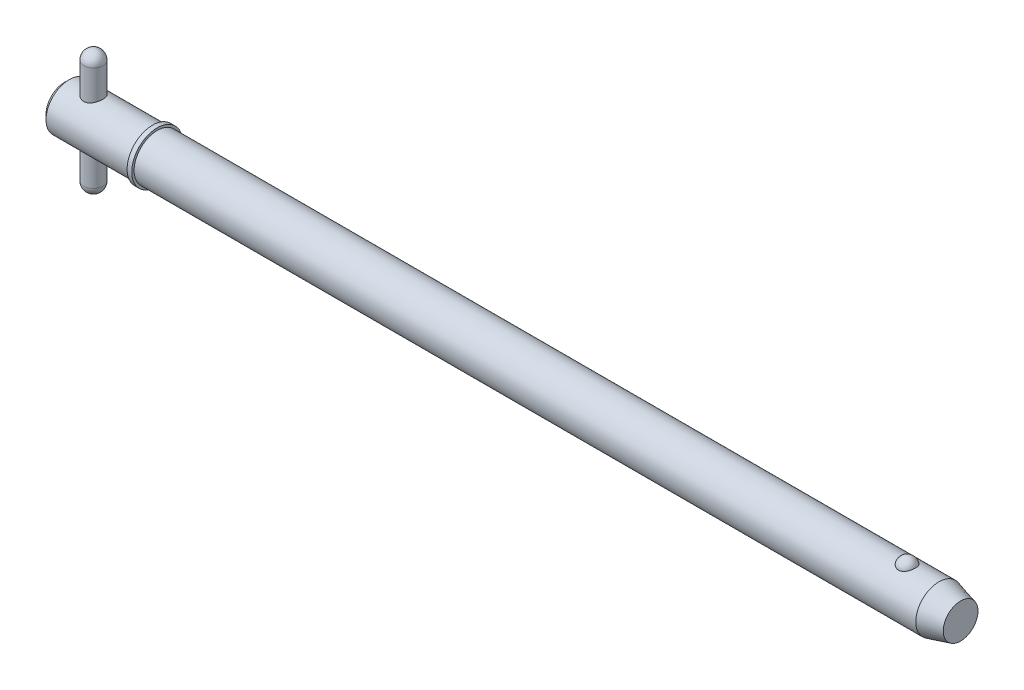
ISO-10303-21;
HEADER;
FILE_DESCRIPTION(('STEP AP214'),'2;1');
FILE_NAME('part.step','',(''),(''),'','','');
FILE_SCHEMA(('AUTOMOTIVE_DESIGN { 1 0 10303 214 1 1 1 1 }'));
ENDSEC;
DATA;
#1=APPLICATION_CONTEXT('core data for automotive mechanical design processes');
#2=APPLICATION_PROTOCOL_DEFINITION('international standard','automotive_design',2000,#1);
#3=PRODUCT_CONTEXT('',#1,'mechanical');
#4=PRODUCT('Part','Part','',(#3));
#5=PRODUCT_RELATED_PRODUCT_CATEGORY('part','',(#4));
#6=PRODUCT_DEFINITION_FORMATION('','',#4);
#7=PRODUCT_DEFINITION_CONTEXT('part definition',#1,'design');
#8=PRODUCT_DEFINITION('design','',#6,#7);
#9=PRODUCT_DEFINITION_SHAPE('','',#8);
#10=(LENGTH_UNIT() NAMED_UNIT(*) SI_UNIT(.MILLI.,.METRE.));
#11=(NAMED_UNIT(*) PLANE_ANGLE_UNIT() SI_UNIT($,.RADIAN.));
#12=(NAMED_UNIT(*) SI_UNIT($,.STERADIAN.) SOLID_ANGLE_UNIT());
#13=UNCERTAINTY_MEASURE_WITH_UNIT(LENGTH_MEASURE(1.E-05),#10,'distance_accuracy_value','');
#14=(GEOMETRIC_REPRESENTATION_CONTEXT(3) GLOBAL_UNCERTAINTY_ASSIGNED_CONTEXT((#13)) GLOBAL_UNIT_ASSIGNED_CONTEXT((#10,
#11,#12)) REPRESENTATION_CONTEXT('',''));
#15=CARTESIAN_POINT('',(0.,0.,0.));
#16=DIRECTION('',(0.,0.,1.));
#17=DIRECTION('',(1.,0.,0.));
#18=AXIS2_PLACEMENT_3D('',#15,#16,#17);
#19=CARTESIAN_POINT('',(5.94,12.7,0.));
#20=DIRECTION('',(0.,-1.,0.));
#21=DIRECTION('',(0.,0.,-1.));
#22=AXIS2_PLACEMENT_3D('',#19,#20,#21);
#23=CYLINDRICAL_SURFACE('',#22,1.98);
#24=CARTESIAN_POINT('',(5.94,-10.72,0.));
#25=DIRECTION('',(0.,-1.,0.));
#26=DIRECTION('',(0.,0.,-1.));
#27=AXIS2_PLACEMENT_3D('',#24,#25,#26);
#28=CIRCLE('',#27,1.98);
#29=CARTESIAN_POINT('',(5.94,-10.72,-1.98));
#30=VERTEX_POINT('',#29);
#31=EDGE_CURVE('P0_E10',#30,#30,#28,.F.);
#32=ORIENTED_EDGE('',*,*,#31,.T.);
#33=EDGE_LOOP('',(#32));
#34=FACE_BOUND('',#33,.T.);
#35=CARTESIAN_POINT('',(5.94,10.72,0.));
#36=DIRECTION('',(0.,-1.,0.));
#37=DIRECTION('',(0.,0.,-1.));
#38=AXIS2_PLACEMENT_3D('',#35,#36,#37);
#39=CIRCLE('',#38,1.98);
#40=CARTESIAN_POINT('',(5.94,10.72,-1.98));
#41=VERTEX_POINT('',#40);
#42=EDGE_CURVE('P0_E21',#41,#41,#39,.T.);
#43=ORIENTED_EDGE('',*,*,#42,.T.);
#44=EDGE_LOOP('',(#43));
#45=FACE_BOUND('',#44,.T.);
#46=ADVANCED_FACE('P0_F14',(#34,#45),#23,.T.);
#47=CARTESIAN_POINT('',(5.94,-10.72,0.));
#48=DIRECTION('',(0.,0.,1.));
#49=DIRECTION('',(1.,0.,0.));
#50=AXIS2_PLACEMENT_3D('',#47,#48,#49);
#51=SPHERICAL_SURFACE('',#50,1.98);
#52=CARTESIAN_POINT('',(5.94,-10.72,0.));
#53=DIRECTION('',(0.,-1.,0.));
#54=DIRECTION('',(0.,0.,-1.));
#55=AXIS2_PLACEMENT_3D('',#52,#53,#54);
#56=SPHERICAL_SURFACE('',#55,1.98);
#57=ORIENTED_EDGE('',*,*,#31,.F.);
#58=EDGE_LOOP('',(#57));
#59=FACE_BOUND('',#58,.T.);
#60=ADVANCED_FACE('P0_F29',(#59),#56,.T.);
#61=CARTESIAN_POINT('',(5.94,10.72,0.));
#62=DIRECTION('',(0.,0.,1.));
#63=DIRECTION('',(1.,0.,0.));
#64=AXIS2_PLACEMENT_3D('',#61,#62,#63);
#65=SPHERICAL_SURFACE('',#64,1.98);
#66=CARTESIAN_POINT('',(5.94,10.72,0.));
#67=DIRECTION('',(0.,-1.,0.));
#68=DIRECTION('',(0.,0.,-1.));
#69=AXIS2_PLACEMENT_3D('',#66,#67,#68);
#70=SPHERICAL_SURFACE('',#69,1.98);
#71=ORIENTED_EDGE('',*,*,#42,.F.);
#72=EDGE_LOOP('',(#71));
#73=FACE_BOUND('',#72,.T.);
#74=ADVANCED_FACE('P0_F16',(#73),#70,.T.);
#75=CLOSED_SHELL('',(#46,#60,#74));
#76=MANIFOLD_SOLID_BREP('P0_B1',#75);
#77=CARTESIAN_POINT('',(0.,0.,0.));
#78=DIRECTION('',(1.,0.,0.));
#79=DIRECTION('',(0.,0.,-1.));
#80=AXIS2_PLACEMENT_3D('',#77,#78,#79);
#81=CYLINDRICAL_SURFACE('',#80,4.765);
#82=CARTESIAN_POINT('',(179.704194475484,0.,0.));
#83=DIRECTION('',(1.,0.,0.));
#84=DIRECTION('',(0.,0.,-1.));
#85=AXIS2_PLACEMENT_3D('',#82,#83,#84);
#86=CIRCLE('',#85,4.765);
#87=CARTESIAN_POINT('',(179.704194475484,0.,-4.765));
#88=VERTEX_POINT('',#87);
#89=EDGE_CURVE('P1_E81',#88,#88,#86,.T.);
#90=ORIENTED_EDGE('',*,*,#89,.F.);
#91=EDGE_LOOP('',(#90));
#92=FACE_BOUND('',#91,.T.);
#93=CARTESIAN_POINT('',(19.05,0.,0.));
#94=DIRECTION('',(1.,0.,0.));
#95=DIRECTION('',(0.,0.,-1.));
#96=AXIS2_PLACEMENT_3D('',#93,#94,#95);
#97=CIRCLE('',#96,4.765);
#98=CARTESIAN_POINT('',(19.05,0.,-4.765));
#99=VERTEX_POINT('',#98);
#100=EDGE_CURVE('P1_E85',#99,#99,#97,.T.);
#101=ORIENTED_EDGE('',*,*,#100,.T.);
#102=EDGE_LOOP('',(#101));
#103=FACE_BOUND('',#102,.T.);
#104=CARTESIAN_POINT('',(173.151020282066,4.42764777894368,1.76101111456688));
#105=CARTESIAN_POINT('',(173.059721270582,4.42764470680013,1.76101422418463));
#106=CARTESIAN_POINT('',(172.968446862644,4.43059091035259,1.75366340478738));
#107=CARTESIAN_POINT('',(172.788615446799,4.44201846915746,1.72451180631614));
#108=CARTESIAN_POINT('',(172.700057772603,4.45049845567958,1.70271460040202));
#109=CARTESIAN_POINT('',(172.528257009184,4.47200516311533,1.64539370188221));
#110=CARTESIAN_POINT('',(172.445006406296,4.48502527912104,1.60988994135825));
#111=CARTESIAN_POINT('',(172.285763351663,4.51419542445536,1.52617873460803));
#112=CARTESIAN_POINT('',(172.209772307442,4.53034605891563,1.47796883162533));
#113=CARTESIAN_POINT('',(172.064744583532,4.56459317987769,1.36860494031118));
#114=CARTESIAN_POINT('',(171.995964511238,4.58273170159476,1.30712420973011));
#115=CARTESIAN_POINT('',(171.869342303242,4.61870302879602,1.17370204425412));
#116=CARTESIAN_POINT('',(171.811502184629,4.63653577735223,1.10175868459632));
#117=CARTESIAN_POINT('',(171.705570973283,4.67090140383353,0.945806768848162));
#118=CARTESIAN_POINT('',(171.658030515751,4.68734068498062,0.861402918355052));
#119=CARTESIAN_POINT('',(171.577081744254,4.71628466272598,0.685442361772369));
#120=CARTESIAN_POINT('',(171.543674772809,4.72878898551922,0.593884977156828));
#121=CARTESIAN_POINT('',(171.491287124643,4.74874061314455,0.404781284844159));
#122=CARTESIAN_POINT('',(171.472517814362,4.75611366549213,0.307168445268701));
#123=CARTESIAN_POINT('',(171.450584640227,4.76475393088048,0.109940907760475));
#124=CARTESIAN_POINT('',(171.447420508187,4.76602124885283,0.0103262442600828));
#125=CARTESIAN_POINT('',(171.456740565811,4.76232928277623,-0.187629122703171));
#126=CARTESIAN_POINT('',(171.469158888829,4.7573962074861,-0.285973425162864));
#127=CARTESIAN_POINT('',(171.509280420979,4.74184975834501,-0.479027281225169));
#128=CARTESIAN_POINT('',(171.536983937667,4.7312362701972,-0.573736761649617));
#129=CARTESIAN_POINT('',(171.607158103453,4.70540026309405,-0.756973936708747));
#130=CARTESIAN_POINT('',(171.649646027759,4.69017235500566,-0.845494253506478));
#131=CARTESIAN_POINT('',(171.748520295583,4.65669867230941,-1.01378033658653));
#132=CARTESIAN_POINT('',(171.804907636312,4.63845268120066,-1.09354547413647));
#133=CARTESIAN_POINT('',(171.930552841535,4.60085438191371,-1.24228523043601));
#134=CARTESIAN_POINT('',(171.999843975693,4.58149930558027,-1.31123108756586));
#135=CARTESIAN_POINT('',(172.149606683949,4.54391653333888,-1.43607409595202));
#136=CARTESIAN_POINT('',(172.230077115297,4.52568872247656,-1.49197257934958));
#137=CARTESIAN_POINT('',(172.398150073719,4.49293007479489,-1.58786764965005));
#138=CARTESIAN_POINT('',(172.485544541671,4.47832346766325,-1.62820219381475));
#139=CARTESIAN_POINT('',(172.666553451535,4.45406011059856,-1.69345757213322));
#140=CARTESIAN_POINT('',(172.76016555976,4.44440151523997,-1.71838415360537));
#141=CARTESIAN_POINT('',(172.945893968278,4.43159888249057,-1.75112843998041));
#142=CARTESIAN_POINT('',(173.037849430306,4.42815213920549,-1.75974223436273));
#143=CARTESIAN_POINT('',(173.221965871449,4.427247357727,-1.76201865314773));
#144=CARTESIAN_POINT('',(173.314126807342,4.42978816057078,-1.7556841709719));
#145=CARTESIAN_POINT('',(173.493129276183,4.44038648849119,-1.72869560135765));
#146=CARTESIAN_POINT('',(173.580047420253,4.44827555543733,-1.70847853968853));
#147=CARTESIAN_POINT('',(173.749131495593,4.46852246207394,-1.65479562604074));
#148=CARTESIAN_POINT('',(173.831297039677,4.48088066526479,-1.62132869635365));
#149=CARTESIAN_POINT('',(173.990591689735,4.50907357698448,-1.54120560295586));
#150=CARTESIAN_POINT('',(174.067570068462,4.52497884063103,-1.49427526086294));
#151=CARTESIAN_POINT('',(174.212708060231,4.55845148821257,-1.38881222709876));
#152=CARTESIAN_POINT('',(174.280865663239,4.57601924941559,-1.33027689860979));
#153=CARTESIAN_POINT('',(174.410099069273,4.61196537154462,-1.1999104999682));
#154=CARTESIAN_POINT('',(174.470656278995,4.63034074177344,-1.12756415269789));
#155=CARTESIAN_POINT('',(174.579279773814,4.66513959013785,-0.97361299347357));
#156=CARTESIAN_POINT('',(174.627343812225,4.68156271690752,-0.892006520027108));
#157=CARTESIAN_POINT('',(174.711383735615,4.71130224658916,-0.718892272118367));
#158=CARTESIAN_POINT('',(174.746918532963,4.724501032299,-0.627149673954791));
#159=CARTESIAN_POINT('',(174.802952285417,4.74571823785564,-0.438611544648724));
#160=CARTESIAN_POINT('',(174.823450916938,4.75373654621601,-0.34181590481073));
#161=CARTESIAN_POINT('',(174.849033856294,4.76378905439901,-0.145633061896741));
#162=CARTESIAN_POINT('',(174.854076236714,4.76580697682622,-0.0462395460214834));
#163=CARTESIAN_POINT('',(174.848523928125,4.7636057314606,0.152038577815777));
#164=CARTESIAN_POINT('',(174.837929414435,4.75938663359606,0.250923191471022));
#165=CARTESIAN_POINT('',(174.801387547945,4.74516937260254,0.445004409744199));
#166=CARTESIAN_POINT('',(174.775496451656,4.73519238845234,0.540213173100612));
#167=CARTESIAN_POINT('',(174.708927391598,4.71049394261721,0.724662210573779));
#168=CARTESIAN_POINT('',(174.668248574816,4.69577220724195,0.813902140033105));
#169=CARTESIAN_POINT('',(174.572717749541,4.66303767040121,0.984313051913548));
#170=CARTESIAN_POINT('',(174.517804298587,4.64501070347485,1.06544688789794));
#171=CARTESIAN_POINT('',(174.395049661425,4.60764678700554,1.21692673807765));
#172=CARTESIAN_POINT('',(174.327208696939,4.58830985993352,1.28727293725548));
#173=CARTESIAN_POINT('',(174.180548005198,4.55060370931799,1.41479271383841));
#174=CARTESIAN_POINT('',(174.101791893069,4.53222967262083,1.47203785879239));
#175=CARTESIAN_POINT('',(173.934989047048,4.49849576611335,1.57212016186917));
#176=CARTESIAN_POINT('',(173.846941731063,4.48313608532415,1.6149564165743));
#177=CARTESIAN_POINT('',(173.659791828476,4.45676184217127,1.68642657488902));
#178=CARTESIAN_POINT('',(173.560365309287,4.44598302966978,1.71430590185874));
#179=CARTESIAN_POINT('',(173.357621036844,4.43142918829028,1.7515925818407));
#180=CARTESIAN_POINT('',(173.254304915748,4.42765125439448,1.76100759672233));
#181=CARTESIAN_POINT('',(173.151020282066,4.42764777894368,1.76101111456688));
#182=B_SPLINE_CURVE_WITH_KNOTS('',3,(#104,#105,#106,#107,#108,#109,#110,#111,#112,#113,#114,
#115,#116,#117,#118,#119,#120,#121,#122,#123,#124,#125,#126,#127,#128,#129,#130,#131,#132,#133,
#134,#135,#136,#137,#138,#139,#140,#141,#142,#143,#144,#145,#146,#147,#148,#149,#150,#151,#152,
#153,#154,#155,#156,#157,#158,#159,#160,#161,#162,#163,#164,#165,#166,#167,#168,#169,#170,#171,
#172,#173,#174,#175,#176,#177,#178,#179,#180,#181),.UNSPECIFIED.,.T.,.F.,(4,2,2,2,2,2,2,2,2,2,2,
2,2,2,2,2,2,2,2,2,2,2,2,2,2,2,2,2,2,2,2,2,2,2,2,2,2,2,4),(0.,0.273517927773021,
0.546968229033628,0.820022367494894,1.09312934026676,1.37393946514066,1.6548013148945,
1.94820420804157,2.24163496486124,2.53922817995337,2.83681628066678,3.13315071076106,
3.42949110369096,3.72617893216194,4.02288805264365,4.32037303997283,4.61782764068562,
4.90840095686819,5.19886582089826,5.47474855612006,5.75057789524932,6.0180997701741,
6.28564340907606,6.55907787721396,6.83257454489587,7.11962987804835,7.40673679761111,
7.70312663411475,7.9995228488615,8.29672237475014,8.59391856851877,8.89002850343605,
9.18615552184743,9.48358266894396,9.7810047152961,10.0767610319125,10.3725358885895,
10.6820893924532,10.991514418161),.UNSPECIFIED.);
#183=CARTESIAN_POINT('',(173.151020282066,4.42764777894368,1.76101111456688));
#184=VERTEX_POINT('',#183);
#185=EDGE_CURVE('P1_E35',#184,#184,#182,.T.);
#186=ORIENTED_EDGE('',*,*,#185,.T.);
#187=EDGE_LOOP('',(#186));
#188=FACE_BOUND('',#187,.T.);
#189=ADVANCED_FACE('P1_F13',(#92,#103,#188),#81,.T.);
#190=CARTESIAN_POINT('',(0.,0.,0.));
#191=DIRECTION('',(-1.,0.,0.));
#192=DIRECTION('',(0.,0.,1.));
#193=AXIS2_PLACEMENT_3D('',#190,#191,#192);
#194=PLANE('',#193);
#195=CARTESIAN_POINT('',(0.,0.,0.));
#196=DIRECTION('',(1.,0.,0.));
#197=DIRECTION('',(0.,0.,-1.));
#198=AXIS2_PLACEMENT_3D('',#195,#196,#197);
#199=CIRCLE('',#198,3.812);
#200=CARTESIAN_POINT('',(0.,0.,-3.812));
#201=VERTEX_POINT('',#200);
#202=EDGE_CURVE('P1_E9',#201,#201,#199,.T.);
#203=ORIENTED_EDGE('',*,*,#202,.F.);
#204=EDGE_LOOP('',(#203));
#205=FACE_BOUND('',#204,.T.);
#206=ADVANCED_FACE('P1_F15',(#205),#194,.T.);
#207=CARTESIAN_POINT('',(0.952999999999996,0.,0.));
#208=DIRECTION('',(1.,0.,0.));
#209=DIRECTION('',(0.,0.,-1.));
#210=AXIS2_PLACEMENT_3D('',#207,#208,#209);
#211=CONICAL_SURFACE('',#210,4.765,0.78539816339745);
#212=ORIENTED_EDGE('',*,*,#202,.T.);
#213=EDGE_LOOP('',(#212));
#214=FACE_BOUND('',#213,.T.);
#215=CARTESIAN_POINT('',(0.952999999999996,0.,0.));
#216=DIRECTION('',(1.,0.,0.));
#217=DIRECTION('',(0.,0.,-1.));
#218=AXIS2_PLACEMENT_3D('',#215,#216,#217);
#219=CIRCLE('',#218,4.765);
#220=CARTESIAN_POINT('',(0.952999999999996,0.,-4.765));
#221=VERTEX_POINT('',#220);
#222=EDGE_CURVE('P1_E26',#221,#221,#219,.T.);
#223=ORIENTED_EDGE('',*,*,#222,.F.);
#224=EDGE_LOOP('',(#223));
#225=FACE_BOUND('',#224,.T.);
#226=ADVANCED_FACE('P1_F77',(#214,#225),#211,.T.);
#227=CARTESIAN_POINT('',(0.,0.,0.));
#228=DIRECTION('',(1.,0.,0.));
#229=DIRECTION('',(0.,0.,-1.));
#230=AXIS2_PLACEMENT_3D('',#227,#228,#229);
#231=CYLINDRICAL_SURFACE('',#230,4.765);
#232=CARTESIAN_POINT('',(5.94,-4.33414639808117,1.98));
#233=CARTESIAN_POINT('',(5.83435484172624,-4.33415447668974,1.97999169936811));
#234=CARTESIAN_POINT('',(5.72854887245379,-4.33806396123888,1.97149330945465));
#235=CARTESIAN_POINT('',(5.51998191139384,-4.35319906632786,1.93783487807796));
#236=CARTESIAN_POINT('',(5.41723000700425,-4.3644446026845,1.91262947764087));
#237=CARTESIAN_POINT('',(5.21817294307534,-4.39274225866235,1.84670269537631));
#238=CARTESIAN_POINT('',(5.12184344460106,-4.40977076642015,1.80604432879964));
#239=CARTESIAN_POINT('',(4.93740039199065,-4.44768106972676,1.71055160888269));
#240=CARTESIAN_POINT('',(4.84928487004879,-4.46856193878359,1.65572066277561));
#241=CARTESIAN_POINT('',(4.67826533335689,-4.51326966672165,1.52981120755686));
#242=CARTESIAN_POINT('',(4.59593118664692,-4.53719608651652,1.45799365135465));
#243=CARTESIAN_POINT('',(4.44405452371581,-4.58448035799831,1.30170177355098));
#244=CARTESIAN_POINT('',(4.37451692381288,-4.60783798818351,1.21722260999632));
#245=CARTESIAN_POINT('',(4.24730683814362,-4.65256187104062,1.03353484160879));
#246=CARTESIAN_POINT('',(4.19027484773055,-4.67379892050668,0.933848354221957));
#247=CARTESIAN_POINT('',(4.0940363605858,-4.7106711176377,0.7252544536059));
#248=CARTESIAN_POINT('',(4.05482199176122,-4.72630873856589,0.61635113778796));
#249=CARTESIAN_POINT('',(3.99739515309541,-4.74951416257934,0.398397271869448));
#250=CARTESIAN_POINT('',(3.97820018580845,-4.7574579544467,0.289646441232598));
#251=CARTESIAN_POINT('',(3.95818309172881,-4.76574596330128,0.0701967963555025));
#252=CARTESIAN_POINT('',(3.95735355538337,-4.76609324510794,-0.0405012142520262));
#253=CARTESIAN_POINT('',(3.9735743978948,-4.75937098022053,-0.253561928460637));
#254=CARTESIAN_POINT('',(3.98954548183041,-4.75274912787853,-0.356023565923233));
#255=CARTESIAN_POINT('',(4.03706504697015,-4.73344665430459,-0.556659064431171));
#256=CARTESIAN_POINT('',(4.06861467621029,-4.72076558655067,-0.654832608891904));
#257=CARTESIAN_POINT('',(4.14677192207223,-4.69032846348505,-0.845904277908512));
#258=CARTESIAN_POINT('',(4.19360181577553,-4.67249797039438,-0.938699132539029));
#259=CARTESIAN_POINT('',(4.30077315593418,-4.63350852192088,-1.11535616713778));
#260=CARTESIAN_POINT('',(4.3611193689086,-4.61234839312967,-1.19921518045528));
#261=CARTESIAN_POINT('',(4.49853487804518,-4.56707259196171,-1.3618711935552));
#262=CARTESIAN_POINT('',(4.57648039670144,-4.5428537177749,-1.43990029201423));
#263=CARTESIAN_POINT('',(4.74440779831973,-4.49530722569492,-1.58211009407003));
#264=CARTESIAN_POINT('',(4.83439425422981,-4.47197995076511,-1.64628551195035));
#265=CARTESIAN_POINT('',(5.02755026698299,-4.42812342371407,-1.76092221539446));
#266=CARTESIAN_POINT('',(5.13105348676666,-4.40770990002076,-1.81086937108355));
#267=CARTESIAN_POINT('',(5.34607555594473,-4.37336901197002,-1.89231211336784));
#268=CARTESIAN_POINT('',(5.45758864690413,-4.3594370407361,-1.92382080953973));
#269=CARTESIAN_POINT('',(5.67777275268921,-4.34077746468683,-1.96554536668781));
#270=CARTESIAN_POINT('',(5.78616167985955,-4.33551319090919,-1.9770057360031));
#271=CARTESIAN_POINT('',(6.00341835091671,-4.33325118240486,-1.98196183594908));
#272=CARTESIAN_POINT('',(6.11228591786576,-4.33625061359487,-1.97546372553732));
#273=CARTESIAN_POINT('',(6.32012423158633,-4.34962383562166,-1.94582288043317));
#274=CARTESIAN_POINT('',(6.41928436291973,-4.35951709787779,-1.92376364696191));
#275=CARTESIAN_POINT('',(6.61241543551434,-4.38495043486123,-1.86506038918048));
#276=CARTESIAN_POINT('',(6.70638516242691,-4.40049182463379,-1.82841296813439));
#277=CARTESIAN_POINT('',(6.89090272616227,-4.43627016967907,-1.73985559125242));
#278=CARTESIAN_POINT('',(6.98113841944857,-4.45667771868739,-1.68736639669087));
#279=CARTESIAN_POINT('',(7.1519532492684,-4.49964530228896,-1.56919282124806));
#280=CARTESIAN_POINT('',(7.232528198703,-4.52220626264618,-1.50350275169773));
#281=CARTESIAN_POINT('',(7.38851617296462,-4.56914071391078,-1.35452895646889));
#282=CARTESIAN_POINT('',(7.46298462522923,-4.5935132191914,-1.27025197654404));
#283=CARTESIAN_POINT('',(7.59689029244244,-4.63962841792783,-1.08983181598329));
#284=CARTESIAN_POINT('',(7.65632644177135,-4.66137092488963,-0.993687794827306));
#285=CARTESIAN_POINT('',(7.75840361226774,-4.69991192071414,-0.791608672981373));
#286=CARTESIAN_POINT('',(7.80100481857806,-4.71669866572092,-0.685651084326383));
#287=CARTESIAN_POINT('',(7.86746997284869,-4.74331408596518,-0.467197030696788));
#288=CARTESIAN_POINT('',(7.8913450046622,-4.75314687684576,-0.354704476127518));
#289=CARTESIAN_POINT('',(7.91828971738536,-4.76427543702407,-0.134819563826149));
#290=CARTESIAN_POINT('',(7.92269147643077,-4.76611762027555,-0.027616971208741));
#291=CARTESIAN_POINT('',(7.91414154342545,-4.76256684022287,0.185959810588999));
#292=CARTESIAN_POINT('',(7.90119286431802,-4.75717513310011,0.292334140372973));
#293=CARTESIAN_POINT('',(7.85926572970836,-4.74004856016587,0.497383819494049));
#294=CARTESIAN_POINT('',(7.83086647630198,-4.72854322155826,0.596198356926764));
#295=CARTESIAN_POINT('',(7.75947503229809,-4.70045111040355,0.787624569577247));
#296=CARTESIAN_POINT('',(7.71648006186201,-4.68386336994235,0.880235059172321));
#297=CARTESIAN_POINT('',(7.6149456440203,-4.64628321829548,1.06122875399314));
#298=CARTESIAN_POINT('',(7.55579211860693,-4.62512577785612,1.14923242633));
#299=CARTESIAN_POINT('',(7.42451813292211,-4.58091700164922,1.31443888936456));
#300=CARTESIAN_POINT('',(7.35239289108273,-4.5578649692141,1.39163767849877));
#301=CARTESIAN_POINT('',(7.19146107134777,-4.51050832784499,1.53847013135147));
#302=CARTESIAN_POINT('',(7.10185635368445,-4.48622440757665,1.60723941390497));
#303=CARTESIAN_POINT('',(6.91164948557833,-4.44076541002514,1.72888900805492));
#304=CARTESIAN_POINT('',(6.81104124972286,-4.41959206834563,1.78176046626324));
#305=CARTESIAN_POINT('',(6.60181953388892,-4.38318936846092,1.86953227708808));
#306=CARTESIAN_POINT('',(6.49325511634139,-4.3679267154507,1.90453365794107));
#307=CARTESIAN_POINT('',(6.32681512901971,-4.35102038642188,1.94268459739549));
#308=CARTESIAN_POINT('',(6.27079191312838,-4.34638447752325,1.953006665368));
#309=CARTESIAN_POINT('',(6.15793999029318,-4.33925923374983,1.96879053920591));
#310=CARTESIAN_POINT('',(6.10111188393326,-4.33676837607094,1.97425579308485));
#311=CARTESIAN_POINT('',(6.00947316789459,-4.33456308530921,1.97908711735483));
#312=CARTESIAN_POINT('',(5.97474528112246,-4.33414374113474,1.98000272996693));
#313=CARTESIAN_POINT('',(5.94,-4.33414639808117,1.98));
#314=B_SPLINE_CURVE_WITH_KNOTS('',3,(#232,#233,#234,#235,#236,#237,#238,#239,#240,#241,#242,
#243,#244,#245,#246,#247,#248,#249,#250,#251,#252,#253,#254,#255,#256,#257,#258,#259,#260,#261,
#262,#263,#264,#265,#266,#267,#268,#269,#270,#271,#272,#273,#274,#275,#276,#277,#278,#279,#280,
#281,#282,#283,#284,#285,#286,#287,#288,#289,#290,#291,#292,#293,#294,#295,#296,#297,#298,#299,
#300,#301,#302,#303,#304,#305,#306,#307,#308,#309,#310,#311,#312,#313),.UNSPECIFIED.,.T.,.F.,(4,
2,2,2,2,2,2,2,2,2,2,2,2,2,2,2,2,2,2,2,2,2,2,2,2,2,2,2,2,2,2,2,2,2,2,2,2,2,2,2,4),(0.,
0.316814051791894,0.634491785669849,0.950887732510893,1.2672076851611,1.60127705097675,
1.93547449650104,2.28407463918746,2.63252061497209,2.96292077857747,3.29318763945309,
3.60346227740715,3.91375978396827,4.22878888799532,4.54392926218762,4.88117914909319,
5.21855748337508,5.56691259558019,5.91501972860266,6.24062939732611,6.56612741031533,
6.87094948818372,7.17584258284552,7.49361276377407,7.81152017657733,8.15513975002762,
8.4987836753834,8.8432355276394,9.18748334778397,9.50777781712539,9.8280166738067,
10.1370037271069,10.4460496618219,10.7690461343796,11.0921619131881,11.4371238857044,
11.7822776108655,12.1254577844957,12.2967183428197,12.4678572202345,12.5720531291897),.UNSPECIFIED.);
#315=CARTESIAN_POINT('',(5.94,-4.33414639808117,1.98));
#316=VERTEX_POINT('',#315);
#317=EDGE_CURVE('P1_E17',#316,#316,#314,.T.);
#318=ORIENTED_EDGE('',*,*,#317,.F.);
#319=EDGE_LOOP('',(#318));
#320=FACE_BOUND('',#319,.T.);
#321=CARTESIAN_POINT('',(5.94,4.33414639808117,1.98));
#322=CARTESIAN_POINT('',(6.04564515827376,4.33415447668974,1.97999169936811));
#323=CARTESIAN_POINT('',(6.15145112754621,4.33806396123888,1.97149330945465));
#324=CARTESIAN_POINT('',(6.36001808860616,4.35319906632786,1.93783487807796));
#325=CARTESIAN_POINT('',(6.46276999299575,4.3644446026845,1.91262947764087));
#326=CARTESIAN_POINT('',(6.66182705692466,4.39274225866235,1.84670269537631));
#327=CARTESIAN_POINT('',(6.75815655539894,4.40977076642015,1.80604432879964));
#328=CARTESIAN_POINT('',(6.94259960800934,4.44768106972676,1.71055160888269));
#329=CARTESIAN_POINT('',(7.03071512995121,4.46856193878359,1.65572066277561));
#330=CARTESIAN_POINT('',(7.20173466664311,4.51326966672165,1.52981120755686));
#331=CARTESIAN_POINT('',(7.28406881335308,4.53719608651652,1.45799365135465));
#332=CARTESIAN_POINT('',(7.43594547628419,4.58448035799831,1.30170177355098));
#333=CARTESIAN_POINT('',(7.50548307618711,4.60783798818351,1.21722260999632));
#334=CARTESIAN_POINT('',(7.63269316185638,4.65256187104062,1.03353484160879));
#335=CARTESIAN_POINT('',(7.68972515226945,4.67379892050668,0.933848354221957));
#336=CARTESIAN_POINT('',(7.7859636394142,4.7106711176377,0.7252544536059));
#337=CARTESIAN_POINT('',(7.82517800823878,4.72630873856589,0.61635113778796));
#338=CARTESIAN_POINT('',(7.88260484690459,4.74951416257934,0.398397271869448));
#339=CARTESIAN_POINT('',(7.90179981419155,4.7574579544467,0.289646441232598));
#340=CARTESIAN_POINT('',(7.92181690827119,4.76574596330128,0.0701967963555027));
#341=CARTESIAN_POINT('',(7.92264644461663,4.76609324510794,-0.040501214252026));
#342=CARTESIAN_POINT('',(7.9064256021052,4.75937098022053,-0.253561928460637));
#343=CARTESIAN_POINT('',(7.89045451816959,4.75274912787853,-0.356023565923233));
#344=CARTESIAN_POINT('',(7.84293495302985,4.73344665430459,-0.55665906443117));
#345=CARTESIAN_POINT('',(7.81138532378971,4.72076558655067,-0.654832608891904));
#346=CARTESIAN_POINT('',(7.73322807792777,4.69032846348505,-0.845904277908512));
#347=CARTESIAN_POINT('',(7.68639818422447,4.67249797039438,-0.938699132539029));
#348=CARTESIAN_POINT('',(7.57922684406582,4.63350852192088,-1.11535616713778));
#349=CARTESIAN_POINT('',(7.5188806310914,4.61234839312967,-1.19921518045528));
#350=CARTESIAN_POINT('',(7.38146512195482,4.56707259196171,-1.3618711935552));
#351=CARTESIAN_POINT('',(7.30351960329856,4.5428537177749,-1.43990029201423));
#352=CARTESIAN_POINT('',(7.13559220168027,4.49530722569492,-1.58211009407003));
#353=CARTESIAN_POINT('',(7.04560574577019,4.47197995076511,-1.64628551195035));
#354=CARTESIAN_POINT('',(6.85244973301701,4.42812342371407,-1.76092221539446));
#355=CARTESIAN_POINT('',(6.74894651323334,4.40770990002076,-1.81086937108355));
#356=CARTESIAN_POINT('',(6.53392444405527,4.37336901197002,-1.89231211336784));
#357=CARTESIAN_POINT('',(6.42241135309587,4.3594370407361,-1.92382080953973));
#358=CARTESIAN_POINT('',(6.20222724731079,4.34077746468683,-1.96554536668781));
#359=CARTESIAN_POINT('',(6.09383832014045,4.33551319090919,-1.9770057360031));
#360=CARTESIAN_POINT('',(5.87658164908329,4.33325118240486,-1.98196183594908));
#361=CARTESIAN_POINT('',(5.76771408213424,4.33625061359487,-1.97546372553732));
#362=CARTESIAN_POINT('',(5.55987576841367,4.34962383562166,-1.94582288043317));
#363=CARTESIAN_POINT('',(5.46071563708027,4.35951709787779,-1.92376364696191));
#364=CARTESIAN_POINT('',(5.26758456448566,4.38495043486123,-1.86506038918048));
#365=CARTESIAN_POINT('',(5.17361483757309,4.40049182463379,-1.82841296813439));
#366=CARTESIAN_POINT('',(4.98909727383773,4.43627016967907,-1.73985559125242));
#367=CARTESIAN_POINT('',(4.89886158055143,4.45667771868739,-1.68736639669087));
#368=CARTESIAN_POINT('',(4.72804675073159,4.49964530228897,-1.56919282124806));
#369=CARTESIAN_POINT('',(4.647471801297,4.52220626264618,-1.50350275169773));
#370=CARTESIAN_POINT('',(4.49148382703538,4.56914071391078,-1.35452895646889));
#371=CARTESIAN_POINT('',(4.41701537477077,4.5935132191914,-1.27025197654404));
#372=CARTESIAN_POINT('',(4.28310970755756,4.63962841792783,-1.08983181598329));
#373=CARTESIAN_POINT('',(4.22367355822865,4.66137092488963,-0.993687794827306));
#374=CARTESIAN_POINT('',(4.12159638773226,4.69991192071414,-0.791608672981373));
#375=CARTESIAN_POINT('',(4.07899518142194,4.71669866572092,-0.685651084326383));
#376=CARTESIAN_POINT('',(4.01253002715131,4.74331408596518,-0.467197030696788));
#377=CARTESIAN_POINT('',(3.98865499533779,4.75314687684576,-0.354704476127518));
#378=CARTESIAN_POINT('',(3.96171028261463,4.76427543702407,-0.134819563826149));
#379=CARTESIAN_POINT('',(3.95730852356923,4.76611762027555,-0.0276169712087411));
#380=CARTESIAN_POINT('',(3.96585845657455,4.76256684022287,0.185959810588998));
#381=CARTESIAN_POINT('',(3.97880713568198,4.75717513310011,0.292334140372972));
#382=CARTESIAN_POINT('',(4.02073427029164,4.74004856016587,0.497383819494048));
#383=CARTESIAN_POINT('',(4.04913352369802,4.72854322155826,0.596198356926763));
#384=CARTESIAN_POINT('',(4.12052496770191,4.70045111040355,0.787624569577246));
#385=CARTESIAN_POINT('',(4.16351993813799,4.68386336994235,0.880235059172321));
#386=CARTESIAN_POINT('',(4.2650543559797,4.64628321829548,1.06122875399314));
#387=CARTESIAN_POINT('',(4.32420788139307,4.62512577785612,1.14923242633));
#388=CARTESIAN_POINT('',(4.45548186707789,4.58091700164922,1.31443888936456));
#389=CARTESIAN_POINT('',(4.52760710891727,4.5578649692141,1.39163767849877));
#390=CARTESIAN_POINT('',(4.68853892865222,4.51050832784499,1.53847013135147));
#391=CARTESIAN_POINT('',(4.77814364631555,4.48622440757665,1.60723941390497));
#392=CARTESIAN_POINT('',(4.96835051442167,4.44076541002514,1.72888900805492));
#393=CARTESIAN_POINT('',(5.06895875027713,4.41959206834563,1.78176046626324));
#394=CARTESIAN_POINT('',(5.27818046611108,4.38318936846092,1.86953227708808));
#395=CARTESIAN_POINT('',(5.38674488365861,4.3679267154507,1.90453365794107));
#396=CARTESIAN_POINT('',(5.55318487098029,4.35102038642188,1.94268459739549));
#397=CARTESIAN_POINT('',(5.60920808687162,4.34638447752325,1.953006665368));
#398=CARTESIAN_POINT('',(5.72206000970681,4.33925923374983,1.96879053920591));
#399=CARTESIAN_POINT('',(5.77888811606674,4.33676837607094,1.97425579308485));
#400=CARTESIAN_POINT('',(5.87052683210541,4.33456308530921,1.97908711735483));
#401=CARTESIAN_POINT('',(5.90525471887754,4.33414374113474,1.98000272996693));
#402=CARTESIAN_POINT('',(5.94,4.33414639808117,1.98));
#403=B_SPLINE_CURVE_WITH_KNOTS('',3,(#321,#322,#323,#324,#325,#326,#327,#328,#329,#330,#331,
#332,#333,#334,#335,#336,#337,#338,#339,#340,#341,#342,#343,#344,#345,#346,#347,#348,#349,#350,
#351,#352,#353,#354,#355,#356,#357,#358,#359,#360,#361,#362,#363,#364,#365,#366,#367,#368,#369,
#370,#371,#372,#373,#374,#375,#376,#377,#378,#379,#380,#381,#382,#383,#384,#385,#386,#387,#388,
#389,#390,#391,#392,#393,#394,#395,#396,#397,#398,#399,#400,#401,#402),.UNSPECIFIED.,.T.,.F.,(4,
2,2,2,2,2,2,2,2,2,2,2,2,2,2,2,2,2,2,2,2,2,2,2,2,2,2,2,2,2,2,2,2,2,2,2,2,2,2,2,4),(0.,
0.316814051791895,0.634491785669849,0.950887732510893,1.2672076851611,1.60127705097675,
1.93547449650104,2.28407463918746,2.63252061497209,2.96292077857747,3.29318763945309,
3.60346227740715,3.91375978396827,4.22878888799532,4.54392926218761,4.88117914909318,
5.21855748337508,5.56691259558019,5.91501972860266,6.24062939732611,6.56612741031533,
6.87094948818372,7.17584258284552,7.49361276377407,7.81152017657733,8.15513975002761,
8.4987836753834,8.84323552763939,9.18748334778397,9.50777781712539,9.8280166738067,
10.1370037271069,10.4460496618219,10.7690461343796,11.0921619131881,11.4371238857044,
11.7822776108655,12.1254577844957,12.2967183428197,12.4678572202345,12.5720531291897),.UNSPECIFIED.);
#404=CARTESIAN_POINT('',(5.94,4.33414639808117,1.98));
#405=VERTEX_POINT('',#404);
#406=EDGE_CURVE('P1_E43',#405,#405,#403,.T.);
#407=ORIENTED_EDGE('',*,*,#406,.F.);
#408=EDGE_LOOP('',(#407));
#409=FACE_BOUND('',#408,.T.);
#410=ORIENTED_EDGE('',*,*,#222,.T.);
#411=EDGE_LOOP('',(#410));
#412=FACE_BOUND('',#411,.T.);
#413=CARTESIAN_POINT('',(18.097,0.,0.));
#414=DIRECTION('',(1.,0.,0.));
#415=DIRECTION('',(0.,0.,-1.));
#416=AXIS2_PLACEMENT_3D('',#413,#414,#415);
#417=CIRCLE('',#416,4.765);
#418=CARTESIAN_POINT('',(18.097,0.,-4.765));
#419=VERTEX_POINT('',#418);
#420=EDGE_CURVE('P1_E31',#419,#419,#417,.T.);
#421=ORIENTED_EDGE('',*,*,#420,.F.);
#422=EDGE_LOOP('',(#421));
#423=FACE_BOUND('',#422,.T.);
#424=ADVANCED_FACE('P1_F103',(#320,#409,#412,#423),#231,.T.);
#425=CARTESIAN_POINT('',(18.097,4.765,0.));
#426=DIRECTION('',(-1.,0.,0.));
#427=DIRECTION('',(0.,0.,1.));
#428=AXIS2_PLACEMENT_3D('',#425,#426,#427);
#429=PLANE('',#428);
#430=ORIENTED_EDGE('',*,*,#420,.T.);
#431=EDGE_LOOP('',(#430));
#432=FACE_BOUND('',#431,.T.);
#433=CARTESIAN_POINT('',(18.097,0.,0.));
#434=DIRECTION('',(1.,0.,0.));
#435=DIRECTION('',(0.,0.,-1.));
#436=AXIS2_PLACEMENT_3D('',#433,#434,#435);
#437=CIRCLE('',#436,5.2415);
#438=CARTESIAN_POINT('',(18.097,0.,-5.2415));
#439=VERTEX_POINT('',#438);
#440=EDGE_CURVE('P1_E91',#439,#439,#437,.T.);
#441=ORIENTED_EDGE('',*,*,#440,.F.);
#442=EDGE_LOOP('',(#441));
#443=FACE_BOUND('',#442,.T.);
#444=ADVANCED_FACE('P1_F100',(#432,#443),#429,.T.);
#445=CARTESIAN_POINT('',(0.,0.,0.));
#446=DIRECTION('',(1.,0.,0.));
#447=DIRECTION('',(0.,0.,-1.));
#448=AXIS2_PLACEMENT_3D('',#445,#446,#447);
#449=CYLINDRICAL_SURFACE('',#448,5.2415);
#450=ORIENTED_EDGE('',*,*,#440,.T.);
#451=EDGE_LOOP('',(#450));
#452=FACE_BOUND('',#451,.T.);
#453=CARTESIAN_POINT('',(19.05,0.,0.));
#454=DIRECTION('',(1.,0.,0.));
#455=DIRECTION('',(0.,0.,-1.));
#456=AXIS2_PLACEMENT_3D('',#453,#454,#455);
#457=CIRCLE('',#456,5.2415);
#458=CARTESIAN_POINT('',(19.05,0.,-5.2415));
#459=VERTEX_POINT('',#458);
#460=EDGE_CURVE('P1_E88',#459,#459,#457,.T.);
#461=ORIENTED_EDGE('',*,*,#460,.F.);
#462=EDGE_LOOP('',(#461));
#463=FACE_BOUND('',#462,.T.);
#464=ADVANCED_FACE('P1_F68',(#452,#463),#449,.T.);
#465=CARTESIAN_POINT('',(19.05,5.2415,0.));
#466=DIRECTION('',(1.,0.,0.));
#467=DIRECTION('',(0.,0.,-1.));
#468=AXIS2_PLACEMENT_3D('',#465,#466,#467);
#469=PLANE('',#468);
#470=ORIENTED_EDGE('',*,*,#460,.T.);
#471=EDGE_LOOP('',(#470));
#472=FACE_BOUND('',#471,.T.);
#473=ORIENTED_EDGE('',*,*,#100,.F.);
#474=EDGE_LOOP('',(#473));
#475=FACE_BOUND('',#474,.T.);
#476=ADVANCED_FACE('P1_F62',(#472,#475),#469,.T.);
#477=CARTESIAN_POINT('',(184.15,0.,0.));
#478=DIRECTION('',(-1.,0.,0.));
#479=DIRECTION('',(0.,0.,1.));
#480=AXIS2_PLACEMENT_3D('',#477,#478,#479);
#481=CONICAL_SURFACE('',#480,3.57375000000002,0.261799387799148);
#482=ORIENTED_EDGE('',*,*,#89,.T.);
#483=EDGE_LOOP('',(#482));
#484=FACE_BOUND('',#483,.T.);
#485=CARTESIAN_POINT('',(184.15,0.,0.));
#486=DIRECTION('',(1.,0.,0.));
#487=DIRECTION('',(0.,0.,-1.));
#488=AXIS2_PLACEMENT_3D('',#485,#486,#487);
#489=CIRCLE('',#488,3.57375000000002);
#490=CARTESIAN_POINT('',(184.15,0.,-3.57375000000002));
#491=VERTEX_POINT('',#490);
#492=EDGE_CURVE('P1_E42',#491,#491,#489,.T.);
#493=ORIENTED_EDGE('',*,*,#492,.F.);
#494=EDGE_LOOP('',(#493));
#495=FACE_BOUND('',#494,.T.);
#496=ADVANCED_FACE('P1_F59',(#484,#495),#481,.T.);
#497=CARTESIAN_POINT('',(184.15,3.57375000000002,0.));
#498=DIRECTION('',(1.,0.,0.));
#499=DIRECTION('',(0.,0.,-1.));
#500=AXIS2_PLACEMENT_3D('',#497,#498,#499);
#501=PLANE('',#500);
#502=ORIENTED_EDGE('',*,*,#492,.T.);
#503=EDGE_LOOP('',(#502));
#504=FACE_BOUND('',#503,.T.);
#505=ADVANCED_FACE('P1_F55',(#504),#501,.T.);
#506=CARTESIAN_POINT('',(173.151020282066,4.2885,0.));
#507=DIRECTION('',(-1.,0.,0.));
#508=DIRECTION('',(0.,1.,0.));
#509=AXIS2_PLACEMENT_3D('',#506,#507,#508);
#510=SPHERICAL_SURFACE('',#509,1.7665);
#511=ORIENTED_EDGE('',*,*,#185,.F.);
#512=EDGE_LOOP('',(#511));
#513=FACE_BOUND('',#512,.T.);
#514=ADVANCED_FACE('P1_F50',(#513),#510,.T.);
#515=CARTESIAN_POINT('',(5.94,-5.2415,0.));
#516=DIRECTION('',(0.,1.,0.));
#517=DIRECTION('',(0.,0.,1.));
#518=AXIS2_PLACEMENT_3D('',#515,#516,#517);
#519=CYLINDRICAL_SURFACE('',#518,1.98);
#520=ORIENTED_EDGE('',*,*,#317,.T.);
#521=EDGE_LOOP('',(#520));
#522=FACE_BOUND('',#521,.T.);
#523=ORIENTED_EDGE('',*,*,#406,.T.);
#524=EDGE_LOOP('',(#523));
#525=FACE_BOUND('',#524,.T.);
#526=ADVANCED_FACE('P1_F54',(#522,#525),#519,.F.);
#527=CLOSED_SHELL('',(#189,#206,#226,#424,#444,#464,#476,#496,#505,#514,#526));
#528=MANIFOLD_SOLID_BREP('P1_B1',#527);
#529=ADVANCED_BREP_SHAPE_REPRESENTATION('',(#18,#76,#528),#14);
#530=SHAPE_DEFINITION_REPRESENTATION(#9,#529);
ENDSEC;
END-ISO-10303-21;
